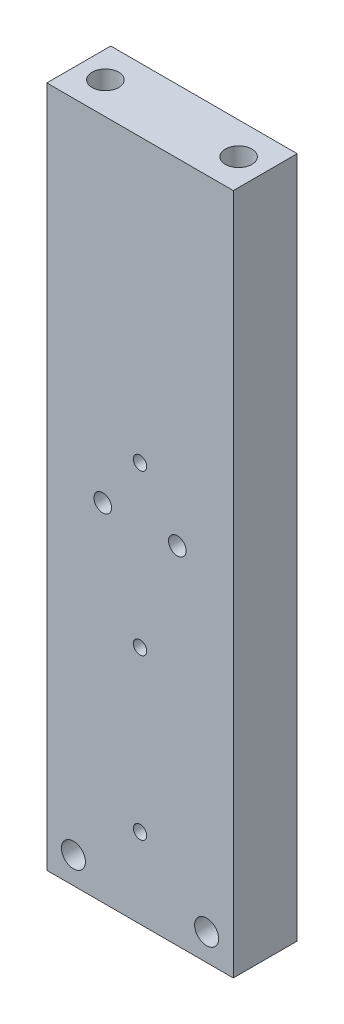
ISO-10303-21;
HEADER;
FILE_DESCRIPTION(('STEP AP214'),'2;1');
FILE_NAME('part.step','',(''),(''),'','','');
FILE_SCHEMA(('AUTOMOTIVE_DESIGN { 1 0 10303 214 1 1 1 1 }'));
ENDSEC;
DATA;
#1=APPLICATION_CONTEXT('core data for automotive mechanical design processes');
#2=APPLICATION_PROTOCOL_DEFINITION('international standard','automotive_design',2000,#1);
#3=PRODUCT_CONTEXT('',#1,'mechanical');
#4=PRODUCT('Part','Part','',(#3));
#5=PRODUCT_RELATED_PRODUCT_CATEGORY('part','',(#4));
#6=PRODUCT_DEFINITION_FORMATION('','',#4);
#7=PRODUCT_DEFINITION_CONTEXT('part definition',#1,'design');
#8=PRODUCT_DEFINITION('design','',#6,#7);
#9=PRODUCT_DEFINITION_SHAPE('','',#8);
#10=(LENGTH_UNIT() NAMED_UNIT(*) SI_UNIT(.MILLI.,.METRE.));
#11=(NAMED_UNIT(*) PLANE_ANGLE_UNIT() SI_UNIT($,.RADIAN.));
#12=(NAMED_UNIT(*) SI_UNIT($,.STERADIAN.) SOLID_ANGLE_UNIT());
#13=UNCERTAINTY_MEASURE_WITH_UNIT(LENGTH_MEASURE(1.E-05),#10,'distance_accuracy_value','');
#14=(GEOMETRIC_REPRESENTATION_CONTEXT(3) GLOBAL_UNCERTAINTY_ASSIGNED_CONTEXT((#13)) GLOBAL_UNIT_ASSIGNED_CONTEXT((#10,
#11,#12)) REPRESENTATION_CONTEXT('',''));
#15=CARTESIAN_POINT('',(0.,0.,0.));
#16=DIRECTION('',(0.,0.,1.));
#17=DIRECTION('',(1.,0.,0.));
#18=AXIS2_PLACEMENT_3D('',#15,#16,#17);
#19=CARTESIAN_POINT('',(-12.5,48.9999999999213,6.));
#20=DIRECTION('',(0.,1.,0.));
#21=DIRECTION('',(0.,0.,1.));
#22=AXIS2_PLACEMENT_3D('',#19,#20,#21);
#23=CONICAL_SURFACE('',#22,2.49999999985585,1.02974425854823);
#24=CARTESIAN_POINT('',(-12.5,47.4978484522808,5.99999999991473));
#25=VERTEX_POINT('',#24);
#26=VERTEX_LOOP('',#25);
#27=FACE_BOUND('',#26,.T.);
#28=CARTESIAN_POINT('',(-12.5,49.,6.));
#29=DIRECTION('',(0.,1.,0.));
#30=DIRECTION('',(0.,0.,1.));
#31=AXIS2_PLACEMENT_3D('',#28,#29,#30);
#32=CIRCLE('',#31,2.5);
#33=CARTESIAN_POINT('',(-12.5,49.,8.5));
#34=VERTEX_POINT('',#33);
#35=EDGE_CURVE('E66',#34,#34,#32,.T.);
#36=ORIENTED_EDGE('',*,*,#35,.T.);
#37=EDGE_LOOP('',(#36));
#38=FACE_BOUND('',#37,.T.);
#39=ADVANCED_FACE('F17',(#27,#38),#23,.F.);
#40=CARTESIAN_POINT('',(12.5,48.9999999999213,6.));
#41=DIRECTION('',(0.,1.,0.));
#42=DIRECTION('',(0.,0.,1.));
#43=AXIS2_PLACEMENT_3D('',#40,#41,#42);
#44=CONICAL_SURFACE('',#43,2.49999999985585,1.02974425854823);
#45=CARTESIAN_POINT('',(12.5,47.4978484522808,5.99999999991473));
#46=VERTEX_POINT('',#45);
#47=VERTEX_LOOP('',#46);
#48=FACE_BOUND('',#47,.T.);
#49=CARTESIAN_POINT('',(12.5,49.,6.));
#50=DIRECTION('',(0.,1.,0.));
#51=DIRECTION('',(0.,0.,1.));
#52=AXIS2_PLACEMENT_3D('',#49,#50,#51);
#53=CIRCLE('',#52,2.5);
#54=CARTESIAN_POINT('',(12.5,49.,8.5));
#55=VERTEX_POINT('',#54);
#56=EDGE_CURVE('E68',#55,#55,#53,.T.);
#57=ORIENTED_EDGE('',*,*,#56,.T.);
#58=EDGE_LOOP('',(#57));
#59=FACE_BOUND('',#58,.T.);
#60=ADVANCED_FACE('F63',(#48,#59),#44,.F.);
#61=CARTESIAN_POINT('',(-12.5,-59.,4.));
#62=DIRECTION('',(0.,0.,-1.));
#63=DIRECTION('',(-1.,0.,0.));
#64=AXIS2_PLACEMENT_3D('',#61,#62,#63);
#65=CYLINDRICAL_SURFACE('',#64,3.75);
#66=CARTESIAN_POINT('',(-12.5,-59.,4.));
#67=DIRECTION('',(0.,0.,-1.));
#68=DIRECTION('',(-1.,0.,0.));
#69=AXIS2_PLACEMENT_3D('',#66,#67,#68);
#70=CIRCLE('',#69,3.75);
#71=CARTESIAN_POINT('',(-16.25,-59.,4.));
#72=VERTEX_POINT('',#71);
#73=EDGE_CURVE('E20',#72,#72,#70,.T.);
#74=ORIENTED_EDGE('',*,*,#73,.F.);
#75=EDGE_LOOP('',(#74));
#76=FACE_BOUND('',#75,.T.);
#77=CARTESIAN_POINT('',(-12.5,-59.,0.));
#78=DIRECTION('',(0.,0.,-1.));
#79=DIRECTION('',(-1.,0.,0.));
#80=AXIS2_PLACEMENT_3D('',#77,#78,#79);
#81=CIRCLE('',#80,3.75);
#82=CARTESIAN_POINT('',(-16.25,-59.,0.));
#83=VERTEX_POINT('',#82);
#84=EDGE_CURVE('E72',#83,#83,#81,.T.);
#85=ORIENTED_EDGE('',*,*,#84,.T.);
#86=EDGE_LOOP('',(#85));
#87=FACE_BOUND('',#86,.T.);
#88=ADVANCED_FACE('F135',(#76,#87),#65,.F.);
#89=CARTESIAN_POINT('',(12.5,-59.,4.));
#90=DIRECTION('',(0.,0.,-1.));
#91=DIRECTION('',(-1.,0.,0.));
#92=AXIS2_PLACEMENT_3D('',#89,#90,#91);
#93=CYLINDRICAL_SURFACE('',#92,3.75);
#94=CARTESIAN_POINT('',(12.5,-59.,4.));
#95=DIRECTION('',(0.,0.,-1.));
#96=DIRECTION('',(-1.,0.,0.));
#97=AXIS2_PLACEMENT_3D('',#94,#95,#96);
#98=CIRCLE('',#97,3.75);
#99=CARTESIAN_POINT('',(8.75000000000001,-59.,4.));
#100=VERTEX_POINT('',#99);
#101=EDGE_CURVE('E69',#100,#100,#98,.T.);
#102=ORIENTED_EDGE('',*,*,#101,.F.);
#103=EDGE_LOOP('',(#102));
#104=FACE_BOUND('',#103,.T.);
#105=CARTESIAN_POINT('',(12.5,-59.,0.));
#106=DIRECTION('',(0.,0.,-1.));
#107=DIRECTION('',(-1.,0.,0.));
#108=AXIS2_PLACEMENT_3D('',#105,#106,#107);
#109=CIRCLE('',#108,3.75);
#110=CARTESIAN_POINT('',(8.75000000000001,-59.,0.));
#111=VERTEX_POINT('',#110);
#112=EDGE_CURVE('E129',#111,#111,#109,.T.);
#113=ORIENTED_EDGE('',*,*,#112,.T.);
#114=EDGE_LOOP('',(#113));
#115=FACE_BOUND('',#114,.T.);
#116=ADVANCED_FACE('F219',(#104,#115),#93,.F.);
#117=CARTESIAN_POINT('',(-12.5,-59.,4.));
#118=DIRECTION('',(0.,0.,-1.));
#119=DIRECTION('',(-1.,0.,0.));
#120=AXIS2_PLACEMENT_3D('',#117,#118,#119);
#121=PLANE('',#120);
#122=CARTESIAN_POINT('',(-12.5,-59.,4.));
#123=DIRECTION('',(0.,0.,-1.));
#124=DIRECTION('',(-1.,0.,0.));
#125=AXIS2_PLACEMENT_3D('',#122,#123,#124);
#126=CIRCLE('',#125,2.25);
#127=CARTESIAN_POINT('',(-14.75,-59.,4.));
#128=VERTEX_POINT('',#127);
#129=EDGE_CURVE('E126',#128,#128,#126,.F.);
#130=ORIENTED_EDGE('',*,*,#129,.T.);
#131=EDGE_LOOP('',(#130));
#132=FACE_BOUND('',#131,.T.);
#133=ORIENTED_EDGE('',*,*,#73,.T.);
#134=EDGE_LOOP('',(#133));
#135=FACE_BOUND('',#134,.T.);
#136=ADVANCED_FACE('F215',(#132,#135),#121,.T.);
#137=CARTESIAN_POINT('',(12.5,-59.,4.));
#138=DIRECTION('',(0.,0.,-1.));
#139=DIRECTION('',(-1.,0.,0.));
#140=AXIS2_PLACEMENT_3D('',#137,#138,#139);
#141=PLANE('',#140);
#142=CARTESIAN_POINT('',(12.5,-59.,4.));
#143=DIRECTION('',(0.,0.,-1.));
#144=DIRECTION('',(-1.,0.,0.));
#145=AXIS2_PLACEMENT_3D('',#142,#143,#144);
#146=CIRCLE('',#145,2.25);
#147=CARTESIAN_POINT('',(10.25,-59.,4.));
#148=VERTEX_POINT('',#147);
#149=EDGE_CURVE('E123',#148,#148,#146,.F.);
#150=ORIENTED_EDGE('',*,*,#149,.T.);
#151=EDGE_LOOP('',(#150));
#152=FACE_BOUND('',#151,.T.);
#153=ORIENTED_EDGE('',*,*,#101,.T.);
#154=EDGE_LOOP('',(#153));
#155=FACE_BOUND('',#154,.T.);
#156=ADVANCED_FACE('F212',(#152,#155),#141,.T.);
#157=CARTESIAN_POINT('',(-12.5,64.,6.));
#158=DIRECTION('',(0.,1.,0.));
#159=DIRECTION('',(0.,0.,1.));
#160=AXIS2_PLACEMENT_3D('',#157,#158,#159);
#161=CYLINDRICAL_SURFACE('',#160,2.5);
#162=ORIENTED_EDGE('',*,*,#35,.F.);
#163=EDGE_LOOP('',(#162));
#164=FACE_BOUND('',#163,.T.);
#165=CARTESIAN_POINT('',(-12.5,64.,6.));
#166=DIRECTION('',(0.,1.,0.));
#167=DIRECTION('',(0.,0.,1.));
#168=AXIS2_PLACEMENT_3D('',#165,#166,#167);
#169=CIRCLE('',#168,2.5);
#170=CARTESIAN_POINT('',(-12.5,64.,8.5));
#171=VERTEX_POINT('',#170);
#172=EDGE_CURVE('E104',#171,#171,#169,.T.);
#173=ORIENTED_EDGE('',*,*,#172,.T.);
#174=EDGE_LOOP('',(#173));
#175=FACE_BOUND('',#174,.T.);
#176=ADVANCED_FACE('F151',(#164,#175),#161,.F.);
#177=CARTESIAN_POINT('',(12.5,64.,6.));
#178=DIRECTION('',(0.,1.,0.));
#179=DIRECTION('',(0.,0.,1.));
#180=AXIS2_PLACEMENT_3D('',#177,#178,#179);
#181=CYLINDRICAL_SURFACE('',#180,2.5);
#182=ORIENTED_EDGE('',*,*,#56,.F.);
#183=EDGE_LOOP('',(#182));
#184=FACE_BOUND('',#183,.T.);
#185=CARTESIAN_POINT('',(12.5,64.,6.));
#186=DIRECTION('',(0.,1.,0.));
#187=DIRECTION('',(0.,0.,1.));
#188=AXIS2_PLACEMENT_3D('',#185,#186,#187);
#189=CIRCLE('',#188,2.5);
#190=CARTESIAN_POINT('',(12.5,64.,8.5));
#191=VERTEX_POINT('',#190);
#192=EDGE_CURVE('E100',#191,#191,#189,.T.);
#193=ORIENTED_EDGE('',*,*,#192,.T.);
#194=EDGE_LOOP('',(#193));
#195=FACE_BOUND('',#194,.T.);
#196=ADVANCED_FACE('F140',(#184,#195),#181,.F.);
#197=CARTESIAN_POINT('',(0.,0.,0.));
#198=DIRECTION('',(0.,0.,1.));
#199=DIRECTION('',(1.,0.,0.));
#200=AXIS2_PLACEMENT_3D('',#197,#198,#199);
#201=PLANE('',#200);
#202=DIRECTION('',(1.,0.,0.));
#203=VECTOR('',#202,1.);
#204=CARTESIAN_POINT('',(-17.5,-64.,0.));
#205=LINE('',#204,#203);
#206=CARTESIAN_POINT('',(17.5,-64.,0.));
#207=VERTEX_POINT('',#206);
#208=CARTESIAN_POINT('',(-17.5,-64.,0.));
#209=VERTEX_POINT('',#208);
#210=EDGE_CURVE('E99',#207,#209,#205,.F.);
#211=ORIENTED_EDGE('',*,*,#210,.T.);
#212=DIRECTION('',(0.,1.,0.));
#213=VECTOR('',#212,1.);
#214=CARTESIAN_POINT('',(-17.5,64.,0.));
#215=LINE('',#214,#213);
#216=CARTESIAN_POINT('',(-17.5,64.,0.));
#217=VERTEX_POINT('',#216);
#218=EDGE_CURVE('E457',#209,#217,#215,.T.);
#219=ORIENTED_EDGE('',*,*,#218,.T.);
#220=DIRECTION('',(1.,0.,0.));
#221=VECTOR('',#220,1.);
#222=CARTESIAN_POINT('',(-17.5,64.,0.));
#223=LINE('',#222,#221);
#224=CARTESIAN_POINT('',(17.5,64.,0.));
#225=VERTEX_POINT('',#224);
#226=EDGE_CURVE('E443',#217,#225,#223,.T.);
#227=ORIENTED_EDGE('',*,*,#226,.T.);
#228=DIRECTION('',(0.,-1.,0.));
#229=VECTOR('',#228,1.);
#230=CARTESIAN_POINT('',(17.5,64.,0.));
#231=LINE('',#230,#229);
#232=EDGE_CURVE('E107',#225,#207,#231,.T.);
#233=ORIENTED_EDGE('',*,*,#232,.T.);
#234=EDGE_LOOP('',(#211,#219,#227,#233));
#235=FACE_BOUND('',#234,.T.);
#236=CARTESIAN_POINT('',(0.,11.,0.));
#237=DIRECTION('',(0.,0.,1.));
#238=DIRECTION('',(1.,0.,0.));
#239=AXIS2_PLACEMENT_3D('',#236,#237,#238);
#240=CIRCLE('',#239,1.24999999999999);
#241=CARTESIAN_POINT('',(1.24999999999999,11.,0.));
#242=VERTEX_POINT('',#241);
#243=EDGE_CURVE('E108',#242,#242,#240,.T.);
#244=ORIENTED_EDGE('',*,*,#243,.T.);
#245=EDGE_LOOP('',(#244));
#246=FACE_BOUND('',#245,.T.);
#247=CARTESIAN_POINT('',(0.,-19.,0.));
#248=DIRECTION('',(0.,0.,1.));
#249=DIRECTION('',(1.,0.,0.));
#250=AXIS2_PLACEMENT_3D('',#247,#248,#249);
#251=CIRCLE('',#250,1.24999999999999);
#252=CARTESIAN_POINT('',(1.24999999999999,-19.,0.));
#253=VERTEX_POINT('',#252);
#254=EDGE_CURVE('E111',#253,#253,#251,.T.);
#255=ORIENTED_EDGE('',*,*,#254,.T.);
#256=EDGE_LOOP('',(#255));
#257=FACE_BOUND('',#256,.T.);
#258=CARTESIAN_POINT('',(0.,-49.,0.));
#259=DIRECTION('',(0.,0.,1.));
#260=DIRECTION('',(1.,0.,0.));
#261=AXIS2_PLACEMENT_3D('',#258,#259,#260);
#262=CIRCLE('',#261,1.24999999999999);
#263=CARTESIAN_POINT('',(1.24999999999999,-49.,0.));
#264=VERTEX_POINT('',#263);
#265=EDGE_CURVE('E114',#264,#264,#262,.T.);
#266=ORIENTED_EDGE('',*,*,#265,.T.);
#267=EDGE_LOOP('',(#266));
#268=FACE_BOUND('',#267,.T.);
#269=CARTESIAN_POINT('',(7.,1.,0.));
#270=DIRECTION('',(0.,0.,1.));
#271=DIRECTION('',(1.,0.,0.));
#272=AXIS2_PLACEMENT_3D('',#269,#270,#271);
#273=CIRCLE('',#272,1.64999999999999);
#274=CARTESIAN_POINT('',(8.64999999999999,1.,0.));
#275=VERTEX_POINT('',#274);
#276=EDGE_CURVE('E117',#275,#275,#273,.T.);
#277=ORIENTED_EDGE('',*,*,#276,.T.);
#278=EDGE_LOOP('',(#277));
#279=FACE_BOUND('',#278,.T.);
#280=CARTESIAN_POINT('',(-7.,0.999999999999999,0.));
#281=DIRECTION('',(0.,0.,1.));
#282=DIRECTION('',(1.,0.,0.));
#283=AXIS2_PLACEMENT_3D('',#280,#281,#282);
#284=CIRCLE('',#283,1.64999999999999);
#285=CARTESIAN_POINT('',(-5.35000000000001,0.999999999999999,0.));
#286=VERTEX_POINT('',#285);
#287=EDGE_CURVE('E120',#286,#286,#284,.T.);
#288=ORIENTED_EDGE('',*,*,#287,.T.);
#289=EDGE_LOOP('',(#288));
#290=FACE_BOUND('',#289,.T.);
#291=ORIENTED_EDGE('',*,*,#112,.F.);
#292=EDGE_LOOP('',(#291));
#293=FACE_BOUND('',#292,.T.);
#294=ORIENTED_EDGE('',*,*,#84,.F.);
#295=EDGE_LOOP('',(#294));
#296=FACE_BOUND('',#295,.T.);
#297=ADVANCED_FACE('F137',(#235,#246,#257,#268,#279,#290,#293,#296),#201,.F.);
#298=CARTESIAN_POINT('',(-12.5,-59.,12.));
#299=DIRECTION('',(0.,0.,-1.));
#300=DIRECTION('',(-1.,0.,0.));
#301=AXIS2_PLACEMENT_3D('',#298,#299,#300);
#302=CYLINDRICAL_SURFACE('',#301,2.25);
#303=ORIENTED_EDGE('',*,*,#129,.F.);
#304=EDGE_LOOP('',(#303));
#305=FACE_BOUND('',#304,.T.);
#306=CARTESIAN_POINT('',(-12.5,-59.,12.));
#307=DIRECTION('',(0.,0.,-1.));
#308=DIRECTION('',(-1.,0.,0.));
#309=AXIS2_PLACEMENT_3D('',#306,#307,#308);
#310=CIRCLE('',#309,2.25);
#311=CARTESIAN_POINT('',(-14.75,-59.,12.));
#312=VERTEX_POINT('',#311);
#313=EDGE_CURVE('E96',#312,#312,#310,.T.);
#314=ORIENTED_EDGE('',*,*,#313,.F.);
#315=EDGE_LOOP('',(#314));
#316=FACE_BOUND('',#315,.T.);
#317=ADVANCED_FACE('F139',(#305,#316),#302,.F.);
#318=CARTESIAN_POINT('',(12.5,-59.,12.));
#319=DIRECTION('',(0.,0.,-1.));
#320=DIRECTION('',(-1.,0.,0.));
#321=AXIS2_PLACEMENT_3D('',#318,#319,#320);
#322=CYLINDRICAL_SURFACE('',#321,2.25);
#323=ORIENTED_EDGE('',*,*,#149,.F.);
#324=EDGE_LOOP('',(#323));
#325=FACE_BOUND('',#324,.T.);
#326=CARTESIAN_POINT('',(12.5,-59.,12.));
#327=DIRECTION('',(0.,0.,-1.));
#328=DIRECTION('',(-1.,0.,0.));
#329=AXIS2_PLACEMENT_3D('',#326,#327,#328);
#330=CIRCLE('',#329,2.25);
#331=CARTESIAN_POINT('',(10.25,-59.,12.));
#332=VERTEX_POINT('',#331);
#333=EDGE_CURVE('E93',#332,#332,#330,.T.);
#334=ORIENTED_EDGE('',*,*,#333,.F.);
#335=EDGE_LOOP('',(#334));
#336=FACE_BOUND('',#335,.T.);
#337=ADVANCED_FACE('F148',(#325,#336),#322,.F.);
#338=CARTESIAN_POINT('',(-7.,0.999999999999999,12.));
#339=DIRECTION('',(0.,0.,1.));
#340=DIRECTION('',(1.,0.,0.));
#341=AXIS2_PLACEMENT_3D('',#338,#339,#340);
#342=CYLINDRICAL_SURFACE('',#341,1.64999999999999);
#343=CARTESIAN_POINT('',(-7.,0.999999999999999,12.));
#344=DIRECTION('',(0.,0.,1.));
#345=DIRECTION('',(1.,0.,0.));
#346=AXIS2_PLACEMENT_3D('',#343,#344,#345);
#347=CIRCLE('',#346,1.64999999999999);
#348=CARTESIAN_POINT('',(-5.35000000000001,0.999999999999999,12.));
#349=VERTEX_POINT('',#348);
#350=EDGE_CURVE('E90',#349,#349,#347,.F.);
#351=ORIENTED_EDGE('',*,*,#350,.F.);
#352=EDGE_LOOP('',(#351));
#353=FACE_BOUND('',#352,.T.);
#354=ORIENTED_EDGE('',*,*,#287,.F.);
#355=EDGE_LOOP('',(#354));
#356=FACE_BOUND('',#355,.T.);
#357=ADVANCED_FACE('F195',(#353,#356),#342,.F.);
#358=CARTESIAN_POINT('',(7.,1.,12.));
#359=DIRECTION('',(0.,0.,1.));
#360=DIRECTION('',(1.,0.,0.));
#361=AXIS2_PLACEMENT_3D('',#358,#359,#360);
#362=CYLINDRICAL_SURFACE('',#361,1.64999999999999);
#363=CARTESIAN_POINT('',(7.,1.,12.));
#364=DIRECTION('',(0.,0.,1.));
#365=DIRECTION('',(1.,0.,0.));
#366=AXIS2_PLACEMENT_3D('',#363,#364,#365);
#367=CIRCLE('',#366,1.64999999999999);
#368=CARTESIAN_POINT('',(8.64999999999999,1.,12.));
#369=VERTEX_POINT('',#368);
#370=EDGE_CURVE('E87',#369,#369,#367,.F.);
#371=ORIENTED_EDGE('',*,*,#370,.F.);
#372=EDGE_LOOP('',(#371));
#373=FACE_BOUND('',#372,.T.);
#374=ORIENTED_EDGE('',*,*,#276,.F.);
#375=EDGE_LOOP('',(#374));
#376=FACE_BOUND('',#375,.T.);
#377=ADVANCED_FACE('F191',(#373,#376),#362,.F.);
#378=CARTESIAN_POINT('',(0.,-49.,12.));
#379=DIRECTION('',(0.,0.,1.));
#380=DIRECTION('',(1.,0.,0.));
#381=AXIS2_PLACEMENT_3D('',#378,#379,#380);
#382=CYLINDRICAL_SURFACE('',#381,1.24999999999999);
#383=CARTESIAN_POINT('',(0.,-49.,12.));
#384=DIRECTION('',(0.,0.,1.));
#385=DIRECTION('',(1.,0.,0.));
#386=AXIS2_PLACEMENT_3D('',#383,#384,#385);
#387=CIRCLE('',#386,1.24999999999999);
#388=CARTESIAN_POINT('',(1.24999999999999,-49.,12.));
#389=VERTEX_POINT('',#388);
#390=EDGE_CURVE('E84',#389,#389,#387,.F.);
#391=ORIENTED_EDGE('',*,*,#390,.F.);
#392=EDGE_LOOP('',(#391));
#393=FACE_BOUND('',#392,.T.);
#394=ORIENTED_EDGE('',*,*,#265,.F.);
#395=EDGE_LOOP('',(#394));
#396=FACE_BOUND('',#395,.T.);
#397=ADVANCED_FACE('F187',(#393,#396),#382,.F.);
#398=CARTESIAN_POINT('',(0.,-19.,12.));
#399=DIRECTION('',(0.,0.,1.));
#400=DIRECTION('',(1.,0.,0.));
#401=AXIS2_PLACEMENT_3D('',#398,#399,#400);
#402=CYLINDRICAL_SURFACE('',#401,1.24999999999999);
#403=CARTESIAN_POINT('',(0.,-19.,12.));
#404=DIRECTION('',(0.,0.,1.));
#405=DIRECTION('',(1.,0.,0.));
#406=AXIS2_PLACEMENT_3D('',#403,#404,#405);
#407=CIRCLE('',#406,1.24999999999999);
#408=CARTESIAN_POINT('',(1.24999999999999,-19.,12.));
#409=VERTEX_POINT('',#408);
#410=EDGE_CURVE('E81',#409,#409,#407,.F.);
#411=ORIENTED_EDGE('',*,*,#410,.F.);
#412=EDGE_LOOP('',(#411));
#413=FACE_BOUND('',#412,.T.);
#414=ORIENTED_EDGE('',*,*,#254,.F.);
#415=EDGE_LOOP('',(#414));
#416=FACE_BOUND('',#415,.T.);
#417=ADVANCED_FACE('F183',(#413,#416),#402,.F.);
#418=CARTESIAN_POINT('',(0.,11.,12.));
#419=DIRECTION('',(0.,0.,1.));
#420=DIRECTION('',(1.,0.,0.));
#421=AXIS2_PLACEMENT_3D('',#418,#419,#420);
#422=CYLINDRICAL_SURFACE('',#421,1.24999999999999);
#423=CARTESIAN_POINT('',(0.,11.,12.));
#424=DIRECTION('',(0.,0.,1.));
#425=DIRECTION('',(1.,0.,0.));
#426=AXIS2_PLACEMENT_3D('',#423,#424,#425);
#427=CIRCLE('',#426,1.24999999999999);
#428=CARTESIAN_POINT('',(1.24999999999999,11.,12.));
#429=VERTEX_POINT('',#428);
#430=EDGE_CURVE('E77',#429,#429,#427,.F.);
#431=ORIENTED_EDGE('',*,*,#430,.F.);
#432=EDGE_LOOP('',(#431));
#433=FACE_BOUND('',#432,.T.);
#434=ORIENTED_EDGE('',*,*,#243,.F.);
#435=EDGE_LOOP('',(#434));
#436=FACE_BOUND('',#435,.T.);
#437=ADVANCED_FACE('F179',(#433,#436),#422,.F.);
#438=CARTESIAN_POINT('',(17.5,64.,12.));
#439=DIRECTION('',(-1.,0.,0.));
#440=DIRECTION('',(0.,-1.,0.));
#441=AXIS2_PLACEMENT_3D('',#438,#439,#440);
#442=PLANE('',#441);
#443=DIRECTION('',(0.,0.,-1.));
#444=VECTOR('',#443,1.);
#445=CARTESIAN_POINT('',(17.5,64.,12.));
#446=LINE('',#445,#444);
#447=CARTESIAN_POINT('',(17.5,64.,12.));
#448=VERTEX_POINT('',#447);
#449=EDGE_CURVE('E103',#225,#448,#446,.F.);
#450=ORIENTED_EDGE('',*,*,#449,.T.);
#451=DIRECTION('',(0.,1.,0.));
#452=VECTOR('',#451,1.);
#453=CARTESIAN_POINT('',(17.5,0.,12.));
#454=LINE('',#453,#452);
#455=CARTESIAN_POINT('',(17.5,-64.,12.));
#456=VERTEX_POINT('',#455);
#457=EDGE_CURVE('E80',#456,#448,#454,.T.);
#458=ORIENTED_EDGE('',*,*,#457,.F.);
#459=DIRECTION('',(0.,0.,1.));
#460=VECTOR('',#459,1.);
#461=CARTESIAN_POINT('',(17.5,-64.,12.));
#462=LINE('',#461,#460);
#463=EDGE_CURVE('E454',#456,#207,#462,.F.);
#464=ORIENTED_EDGE('',*,*,#463,.T.);
#465=ORIENTED_EDGE('',*,*,#232,.F.);
#466=EDGE_LOOP('',(#450,#458,#464,#465));
#467=FACE_BOUND('',#466,.T.);
#468=ADVANCED_FACE('F175',(#467),#442,.F.);
#469=CARTESIAN_POINT('',(-17.5,64.,12.));
#470=DIRECTION('',(0.,-1.,0.));
#471=DIRECTION('',(0.,0.,-1.));
#472=AXIS2_PLACEMENT_3D('',#469,#470,#471);
#473=PLANE('',#472);
#474=DIRECTION('',(0.,0.,1.));
#475=VECTOR('',#474,1.);
#476=CARTESIAN_POINT('',(-17.5,64.,12.));
#477=LINE('',#476,#475);
#478=CARTESIAN_POINT('',(-17.5,64.,12.));
#479=VERTEX_POINT('',#478);
#480=EDGE_CURVE('E448',#217,#479,#477,.T.);
#481=ORIENTED_EDGE('',*,*,#480,.T.);
#482=DIRECTION('',(1.,0.,0.));
#483=VECTOR('',#482,1.);
#484=CARTESIAN_POINT('',(0.,64.,12.));
#485=LINE('',#484,#483);
#486=EDGE_CURVE('E446',#448,#479,#485,.F.);
#487=ORIENTED_EDGE('',*,*,#486,.F.);
#488=ORIENTED_EDGE('',*,*,#449,.F.);
#489=ORIENTED_EDGE('',*,*,#226,.F.);
#490=EDGE_LOOP('',(#481,#487,#488,#489));
#491=FACE_BOUND('',#490,.T.);
#492=ORIENTED_EDGE('',*,*,#192,.F.);
#493=EDGE_LOOP('',(#492));
#494=FACE_BOUND('',#493,.T.);
#495=ORIENTED_EDGE('',*,*,#172,.F.);
#496=EDGE_LOOP('',(#495));
#497=FACE_BOUND('',#496,.T.);
#498=ADVANCED_FACE('F172',(#491,#494,#497),#473,.F.);
#499=CARTESIAN_POINT('',(-17.5,64.,12.));
#500=DIRECTION('',(1.,0.,0.));
#501=DIRECTION('',(0.,1.,0.));
#502=AXIS2_PLACEMENT_3D('',#499,#500,#501);
#503=PLANE('',#502);
#504=DIRECTION('',(0.,0.,1.));
#505=VECTOR('',#504,1.);
#506=CARTESIAN_POINT('',(-17.5,-64.,12.));
#507=LINE('',#506,#505);
#508=CARTESIAN_POINT('',(-17.5,-64.,12.));
#509=VERTEX_POINT('',#508);
#510=EDGE_CURVE('E35',#209,#509,#507,.T.);
#511=ORIENTED_EDGE('',*,*,#510,.T.);
#512=DIRECTION('',(0.,1.,0.));
#513=VECTOR('',#512,1.);
#514=CARTESIAN_POINT('',(-17.5,0.,12.));
#515=LINE('',#514,#513);
#516=EDGE_CURVE('E26',#479,#509,#515,.F.);
#517=ORIENTED_EDGE('',*,*,#516,.F.);
#518=ORIENTED_EDGE('',*,*,#480,.F.);
#519=ORIENTED_EDGE('',*,*,#218,.F.);
#520=EDGE_LOOP('',(#511,#517,#518,#519));
#521=FACE_BOUND('',#520,.T.);
#522=ADVANCED_FACE('F164',(#521),#503,.F.);
#523=CARTESIAN_POINT('',(-17.5,-64.,12.));
#524=DIRECTION('',(0.,1.,0.));
#525=DIRECTION('',(0.,0.,1.));
#526=AXIS2_PLACEMENT_3D('',#523,#524,#525);
#527=PLANE('',#526);
#528=ORIENTED_EDGE('',*,*,#463,.F.);
#529=DIRECTION('',(1.,0.,0.));
#530=VECTOR('',#529,1.);
#531=CARTESIAN_POINT('',(0.,-64.,12.));
#532=LINE('',#531,#530);
#533=EDGE_CURVE('E11',#509,#456,#532,.T.);
#534=ORIENTED_EDGE('',*,*,#533,.F.);
#535=ORIENTED_EDGE('',*,*,#510,.F.);
#536=ORIENTED_EDGE('',*,*,#210,.F.);
#537=EDGE_LOOP('',(#528,#534,#535,#536));
#538=FACE_BOUND('',#537,.T.);
#539=ADVANCED_FACE('F158',(#538),#527,.F.);
#540=CARTESIAN_POINT('',(0.,0.,12.));
#541=DIRECTION('',(0.,0.,1.));
#542=DIRECTION('',(1.,0.,0.));
#543=AXIS2_PLACEMENT_3D('',#540,#541,#542);
#544=PLANE('',#543);
#545=ORIENTED_EDGE('',*,*,#516,.T.);
#546=ORIENTED_EDGE('',*,*,#533,.T.);
#547=ORIENTED_EDGE('',*,*,#457,.T.);
#548=ORIENTED_EDGE('',*,*,#486,.T.);
#549=EDGE_LOOP('',(#545,#546,#547,#548));
#550=FACE_BOUND('',#549,.T.);
#551=ORIENTED_EDGE('',*,*,#430,.T.);
#552=EDGE_LOOP('',(#551));
#553=FACE_BOUND('',#552,.T.);
#554=ORIENTED_EDGE('',*,*,#410,.T.);
#555=EDGE_LOOP('',(#554));
#556=FACE_BOUND('',#555,.T.);
#557=ORIENTED_EDGE('',*,*,#390,.T.);
#558=EDGE_LOOP('',(#557));
#559=FACE_BOUND('',#558,.T.);
#560=ORIENTED_EDGE('',*,*,#370,.T.);
#561=EDGE_LOOP('',(#560));
#562=FACE_BOUND('',#561,.T.);
#563=ORIENTED_EDGE('',*,*,#350,.T.);
#564=EDGE_LOOP('',(#563));
#565=FACE_BOUND('',#564,.T.);
#566=ORIENTED_EDGE('',*,*,#333,.T.);
#567=EDGE_LOOP('',(#566));
#568=FACE_BOUND('',#567,.T.);
#569=ORIENTED_EDGE('',*,*,#313,.T.);
#570=EDGE_LOOP('',(#569));
#571=FACE_BOUND('',#570,.T.);
#572=ADVANCED_FACE('F156',(#550,#553,#556,#559,#562,#565,#568,#571),#544,.T.);
#573=CLOSED_SHELL('',(#39,#60,#88,#116,#136,#156,#176,#196,#297,#317,#337,#357,#377,#397,#417,
#437,#468,#498,#522,#539,#572));
#574=MANIFOLD_SOLID_BREP('B1',#573);
#575=ADVANCED_BREP_SHAPE_REPRESENTATION('',(#18,#574),#14);
#576=SHAPE_DEFINITION_REPRESENTATION(#9,#575);
ENDSEC;
END-ISO-10303-21;
